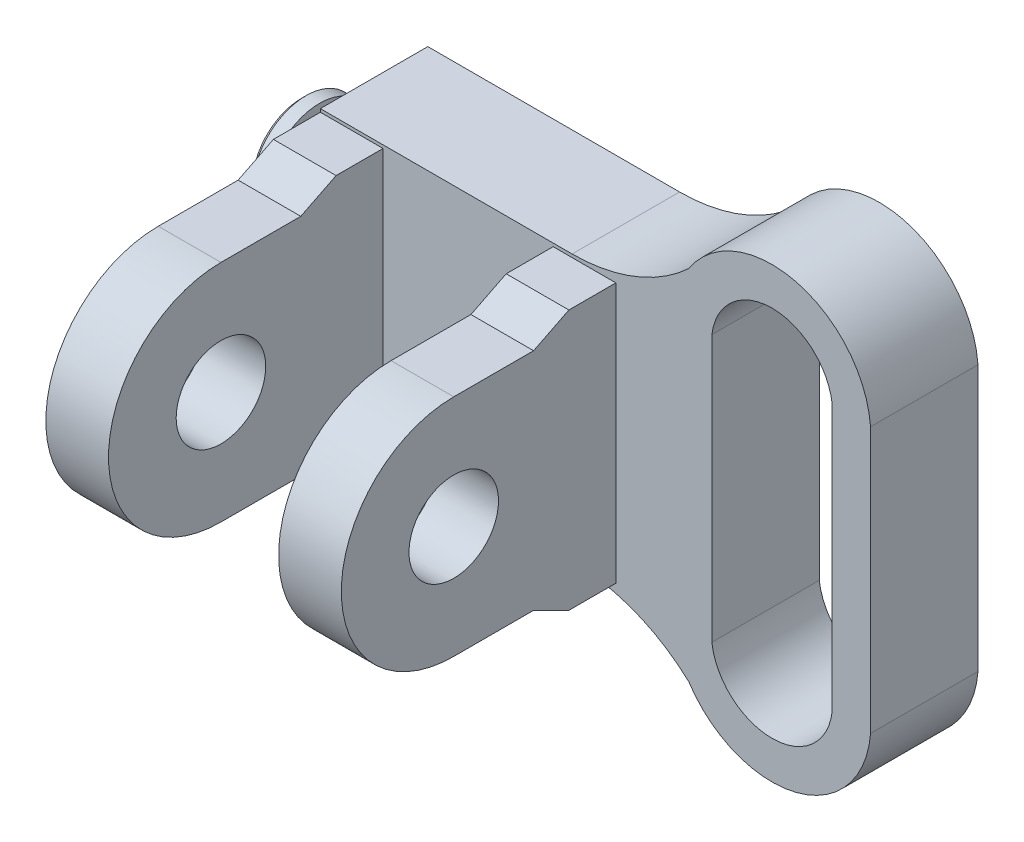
from build123d import *

# Parameters (mm, degrees)
BASE_EXTRUSION_DEPTH       = 12
ENL_V_MAT_EXTRU_1_DEPTH    = 20
BOSS_EXTRU_4_DEPTH         = 7
R_P_TITION_LIN_AIRE1_COUNT = 2
R_P_TITION_LIN_AIRE1_PITCH = 26
ESQUISSE17_R               = 5
ENL_V_MAT_EXTRU_4_DEPTH    = 169.226648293
ESQUISSE16_R               = 3.752937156
BOSS_EXTRU_5_DEPTH         = 4
ESQUISSE19_R               = 6
BOSS_EXTRU_6_DEPTH         = 2
ESQUISSE20_R               = 6
BOSS_EXTRU_7_DEPTH         = 1
CHANFREIN1_SIZE            = 0.5


with BuildPart() as part:
    # Esquisse2 → Base-Extrusion (new body)
    with BuildSketch(Plane.XY):
        with BuildLine():
            Line((237.915887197, 113.664011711), (237.915887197, 143.421521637))
            Line((237.915887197, 143.421521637), (266.034275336, 143.421521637))
            ThreePointArc((266.034275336, 143.421521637), (273.030713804, 144.742277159), (279.064164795, 148.522755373))
            ThreePointArc((279.064164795, 148.522755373), (291.061242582, 153.233215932), (299.362616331, 143.373930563))
            Line((299.362616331, 143.373930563), (299.362616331, 113.711602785))
            ThreePointArc((299.362616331, 113.711602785), (291.061242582, 103.852317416), (279.064164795, 108.562777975))
            ThreePointArc((279.064164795, 108.562777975), (273.030713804, 112.343256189), (266.034275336, 113.664011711))
            Line((266.034275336, 113.664011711), (237.915887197, 113.664011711))
        make_face()
    extrude(amount=-BASE_EXTRUSION_DEPTH)

    # Esquisse1 → Enl_v. mat.-Extru.1 (cut)
    with BuildSketch(Plane.XY):
        with BuildLine():
            Line((295.084594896, 143.373930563), (295.084594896, 113.711602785))
            ThreePointArc((295.084594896, 113.711602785), (288.381793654, 107.736179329), (281.636867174, 113.664011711))
            Line((281.636867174, 113.664011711), (281.636867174, 143.421521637))
            ThreePointArc((281.636867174, 143.421521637), (288.381793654, 149.349354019), (295.084594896, 143.373930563))
        make_face()
    extrude(amount=-ENL_V_MAT_EXTRU_1_DEPTH, mode=Mode.SUBTRACT)

    # Esquisse10 → Boss.-Extru.4 (add)
    with BuildSketch(Plane(origin=(237.915887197, -15.084993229, 99.869116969), x_dir=(0, 1, 0), z_dir=(-1, 0, 0))):
        with BuildLine():
            Line((129.101827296, 111.869116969), (158.153692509, 111.869116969))
            Line((158.153692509, 111.869116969), (158.153692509, 94.624565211))
            Line((158.153692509, 94.624565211), (156.183308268, 90.68379673))
            Line((156.183308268, 90.68379673), (156.183308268, 81.765215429))
            ThreePointArc((156.183308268, 81.765215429), (143.627759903, 69.209667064), (131.072211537, 81.765215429))
            Line((131.072211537, 81.765215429), (131.072211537, 90.68379673))
            Line((131.072211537, 90.68379673), (129.101827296, 94.624565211))
            Line((129.101827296, 94.624565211), (129.101827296, 111.869116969))
        make_face()
    boss_extru_4 = extrude(amount=-BOSS_EXTRU_4_DEPTH)

    # R_p_tition lin_aire1: Boss.-Extru.4 ×2
    with Locations(*[(i * R_P_TITION_LIN_AIRE1_PITCH, 0, 0) for i in range(1, R_P_TITION_LIN_AIRE1_COUNT)]):
        add(boss_extru_4)

    # Esquisse17 → Enl_v. mat.-Extru.4 (cut, through all)
    with BuildSketch(Plane.ZY.offset(-237.915887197)):
        with Locations(Location((18.10390154, 128.542766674, 0), (0, 0, 180))):
            Circle(ESQUISSE17_R)
    extrude(amount=-ENL_V_MAT_EXTRU_4_DEPTH, mode=Mode.SUBTRACT)

    # Esquisse16 → Boss.-Extru.5 (add)
    with BuildSketch(Plane.ZY.offset(-237.915887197)):
        with Locations((-3.91, 133.981521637)):
            Circle(ESQUISSE16_R)
    extrude(amount=BOSS_EXTRU_5_DEPTH)

    # Esquisse19 → Boss.-Extru.6 (add)
    with BuildSketch(Plane.ZY.offset(-233.915887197)):
        with Locations((-3.91, 133.981521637)):
            Circle(ESQUISSE19_R)
    extrude(amount=BOSS_EXTRU_6_DEPTH)

    # Esquisse20 → Boss.-Extru.7 (add)
    with BuildSketch(Plane.ZY.offset(-237.915887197)):
        with Locations((-3.91, 133.981521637)):
            Circle(ESQUISSE20_R)
    extrude(amount=BOSS_EXTRU_7_DEPTH)

    # Chanfrein1
    chanfrein1_edges = [part.edges().sort_by_distance(p)[0] for p in [
        (231.915887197, 133.981521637, -9.91),
    ]]
    chamfer(chanfrein1_edges, length=CHANFREIN1_SIZE)


solid = part.part
